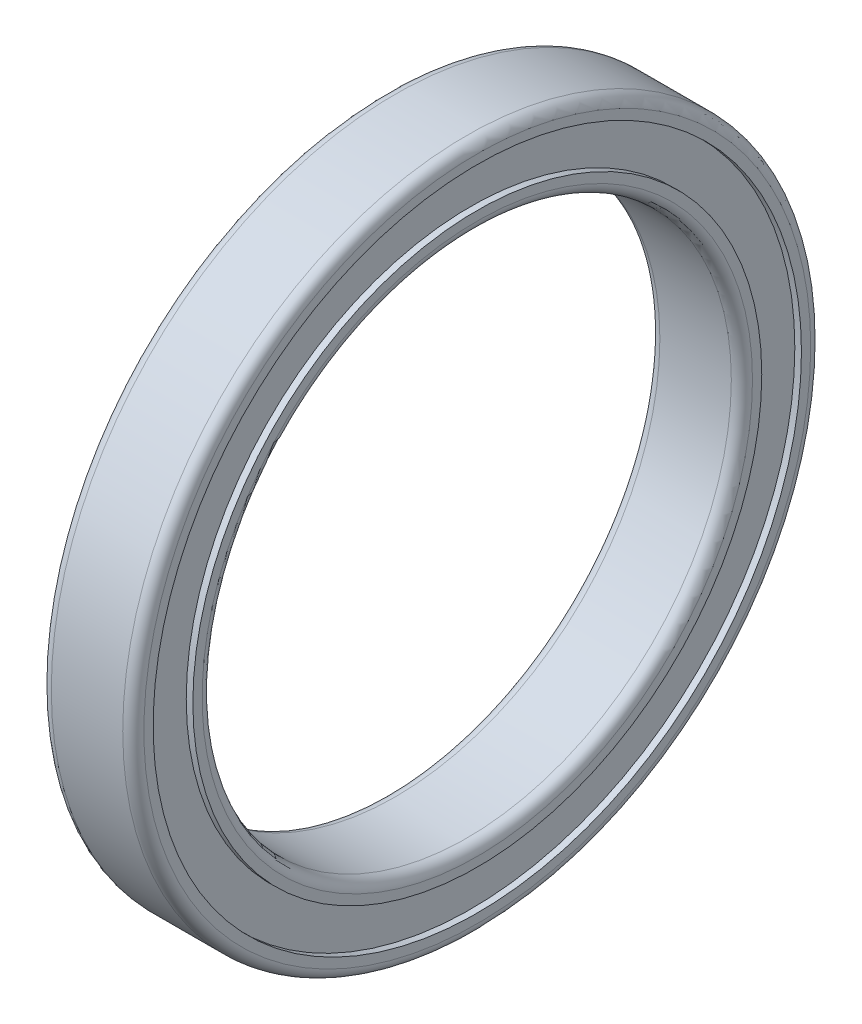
from build123d import *

# Parameters (mm, degrees)
FILLET_1_R = 0.8


with BuildPart() as part:
    # Sketch 1 → Revolve 1 (revolve)
    with BuildSketch(Plane.XY, mode=Mode.PRIVATE) as revolve_1_sk:
        Polygon((3.5, 20), (-3.5, 20), (-3.5, 21.5), (-3, 21.5), (-3, 24.5), (-3.5, 24.5), (-3.5, 26), (3.5, 26), (3.5, 24.5), (3, 24.5), (3, 21.5), (3.5, 21.5), align=None)
    revolve(revolve_1_sk.sketch.rotate(Axis((0, 0, 0), (-1, 0, 0)), 90), axis=Axis((0, 0, 0), (-1, 0, 0)))

    # Fillet 1
    fillet_1_edges = [part.edges().sort_by_distance(p)[0] for p in [
        (-3.5, 0, 26),
        (3.5, 0, 26),
        (3.5, 0, 20),
        (-3.5, 0, 20),
    ]]
    fillet(fillet_1_edges, radius=FILLET_1_R)


solid = part.part
